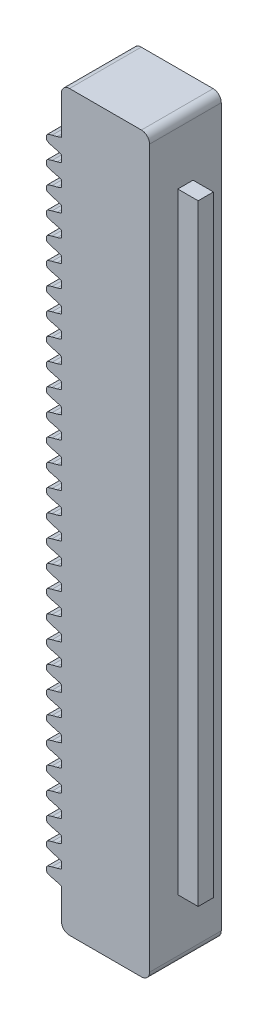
from build123d import *

# Parameters (mm, degrees)
EXTRUDE1_DEPTH  = 44.704
EXTRUDE2_DEPTH  = 44.704
LPATTERN1_COUNT = 30
LPATTERN1_PITCH = 13.620999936
SKETCH2_W       = 9.525
SKETCH2_H       = 381
EXTRUDE3_DEPTH  = 12.7
FILLET1_R       = 5.08


with BuildPart() as part:
    # Sketch1 → Extrude1 (new body)
    with BuildSketch(Plane.XY):
        Polygon((0, 457.2), (0, 33.326919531), (0, 23.976456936), (0, 0), (54.972641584, 0), (54.972641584, 457.2), align=None)
    extrude(amount=EXTRUDE1_DEPTH)

    # Sketch1_3 → Extrude2 (add)
    with BuildSketch(Plane.XY):
        with BuildLine():
            ThreePointArc((-8.755749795, 30.49009462), (-9.029637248, 30.244895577), (-9.1313, 29.891622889))
            Line((-9.1313, 29.891622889), (-9.1313, 27.411753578))
            ThreePointArc((-9.1313, 27.411753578), (-9.029637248, 27.05848089), (-8.755749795, 26.813281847))
            ThreePointArc((-8.755749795, 26.813281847), (-7.317187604, 26.20378459), (-5.825680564, 25.738645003))
            Line((-5.825680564, 25.738645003), (-2.640986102, 24.915027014))
            ThreePointArc((-2.640986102, 24.915027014), (-1.299738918, 24.504140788), (0, 23.976456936))
            Line((0, 23.976456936), (0, 33.326919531))
            ThreePointArc((0, 33.326919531), (-1.299738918, 32.79923568), (-2.640986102, 32.388349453))
            Line((-2.640986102, 32.388349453), (-5.825680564, 31.564731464))
            ThreePointArc((-5.825680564, 31.564731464), (-7.317187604, 31.099591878), (-8.755749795, 30.49009462))
        make_face()
    extrude2 = extrude(amount=EXTRUDE2_DEPTH)

    # LPattern1: Extrude2 ×30
    with Locations(*[(0, i * LPATTERN1_PITCH, 0) for i in range(1, LPATTERN1_COUNT)]):
        add(extrude2)

    # Sketch2 → Extrude3 (add)
    with BuildSketch(Plane(origin=(54.972641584, 0, 0), x_dir=(0, 0, -1), z_dir=(1, 0, 0))):
        with Locations((-22.352, 228.6)):
            Rectangle(SKETCH2_W, SKETCH2_H)
    extrude(amount=EXTRUDE3_DEPTH)

    # Fillet1
    fillet1_edges = [part.edges().sort_by_distance(p)[0] for p in [
        (54.972641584, 0, 22.352),
        (0, 0, 22.352),
        (54.972641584, 457.2, 22.352),
        (0, 457.2, 22.352),
    ]]
    fillet(fillet1_edges, radius=FILLET1_R)


solid = part.part
